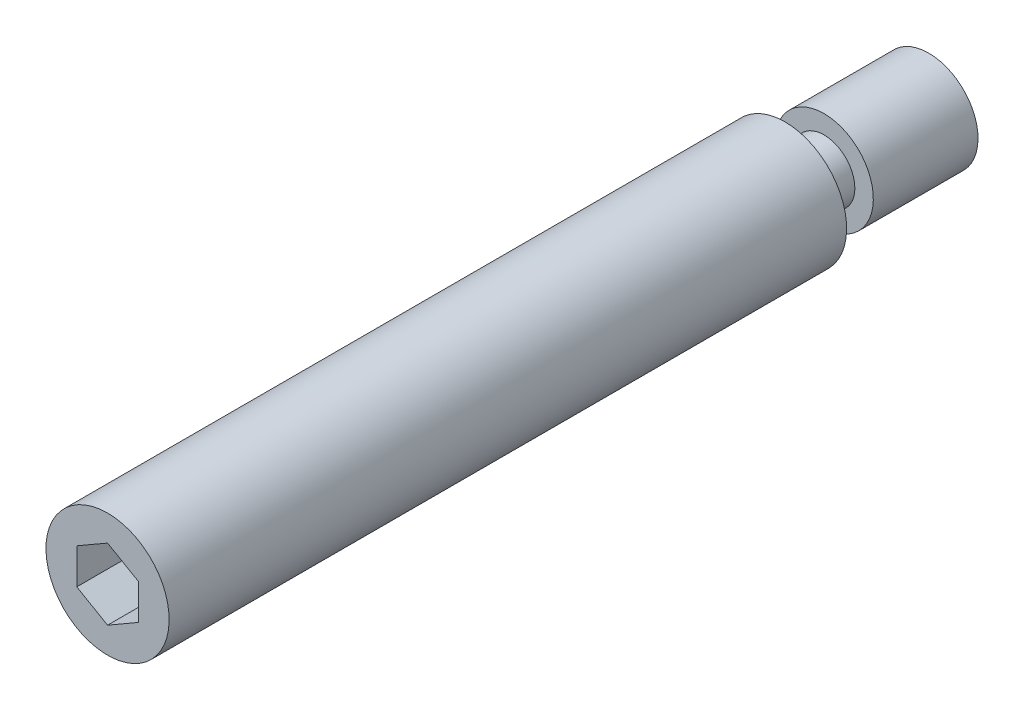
ISO-10303-21;
HEADER;
FILE_DESCRIPTION(('STEP AP214'),'2;1');
FILE_NAME('part.step','',(''),(''),'','','');
FILE_SCHEMA(('AUTOMOTIVE_DESIGN { 1 0 10303 214 1 1 1 1 }'));
ENDSEC;
DATA;
#1=APPLICATION_CONTEXT('core data for automotive mechanical design processes');
#2=APPLICATION_PROTOCOL_DEFINITION('international standard','automotive_design',2000,#1);
#3=PRODUCT_CONTEXT('',#1,'mechanical');
#4=PRODUCT('Part','Part','',(#3));
#5=PRODUCT_RELATED_PRODUCT_CATEGORY('part','',(#4));
#6=PRODUCT_DEFINITION_FORMATION('','',#4);
#7=PRODUCT_DEFINITION_CONTEXT('part definition',#1,'design');
#8=PRODUCT_DEFINITION('design','',#6,#7);
#9=PRODUCT_DEFINITION_SHAPE('','',#8);
#10=(LENGTH_UNIT() NAMED_UNIT(*) SI_UNIT(.MILLI.,.METRE.));
#11=(NAMED_UNIT(*) PLANE_ANGLE_UNIT() SI_UNIT($,.RADIAN.));
#12=(NAMED_UNIT(*) SI_UNIT($,.STERADIAN.) SOLID_ANGLE_UNIT());
#13=UNCERTAINTY_MEASURE_WITH_UNIT(LENGTH_MEASURE(1.E-05),#10,'distance_accuracy_value','');
#14=(GEOMETRIC_REPRESENTATION_CONTEXT(3) GLOBAL_UNCERTAINTY_ASSIGNED_CONTEXT((#13)) GLOBAL_UNIT_ASSIGNED_CONTEXT((#10,
#11,#12)) REPRESENTATION_CONTEXT('',''));
#15=CARTESIAN_POINT('',(0.,0.,0.));
#16=DIRECTION('',(0.,0.,1.));
#17=DIRECTION('',(1.,0.,0.));
#18=AXIS2_PLACEMENT_3D('',#15,#16,#17);
#19=CARTESIAN_POINT('',(0.,-3.,7.));
#20=DIRECTION('',(0.,0.,-1.));
#21=DIRECTION('',(0.,-1.,0.));
#22=AXIS2_PLACEMENT_3D('',#19,#20,#21);
#23=PLANE('',#22);
#24=CARTESIAN_POINT('',(0.,0.,7.));
#25=DIRECTION('',(0.,0.,1.));
#26=DIRECTION('',(0.,1.,0.));
#27=AXIS2_PLACEMENT_3D('',#24,#25,#26);
#28=CIRCLE('',#27,1.5);
#29=CARTESIAN_POINT('',(0.,1.5,7.));
#30=VERTEX_POINT('',#29);
#31=EDGE_CURVE('E115',#30,#30,#28,.T.);
#32=ORIENTED_EDGE('',*,*,#31,.T.);
#33=EDGE_LOOP('',(#32));
#34=FACE_BOUND('',#33,.T.);
#35=CARTESIAN_POINT('',(0.,0.,7.));
#36=DIRECTION('',(0.,0.,1.));
#37=DIRECTION('',(0.,1.,0.));
#38=AXIS2_PLACEMENT_3D('',#35,#36,#37);
#39=CIRCLE('',#38,3.);
#40=CARTESIAN_POINT('',(0.,3.,7.));
#41=VERTEX_POINT('',#40);
#42=EDGE_CURVE('E9',#41,#41,#39,.T.);
#43=ORIENTED_EDGE('',*,*,#42,.F.);
#44=EDGE_LOOP('',(#43));
#45=FACE_BOUND('',#44,.T.);
#46=ADVANCED_FACE('F14',(#34,#45),#23,.T.);
#47=CARTESIAN_POINT('',(0.,0.,20.));
#48=DIRECTION('',(0.,0.,1.));
#49=DIRECTION('',(0.,1.,0.));
#50=AXIS2_PLACEMENT_3D('',#47,#48,#49);
#51=CYLINDRICAL_SURFACE('',#50,3.);
#52=CARTESIAN_POINT('',(0.,0.,40.));
#53=DIRECTION('',(0.,0.,1.));
#54=DIRECTION('',(0.,1.,0.));
#55=AXIS2_PLACEMENT_3D('',#52,#53,#54);
#56=CIRCLE('',#55,3.);
#57=CARTESIAN_POINT('',(0.,3.,40.));
#58=VERTEX_POINT('',#57);
#59=EDGE_CURVE('E21',#58,#58,#56,.T.);
#60=ORIENTED_EDGE('',*,*,#59,.F.);
#61=EDGE_LOOP('',(#60));
#62=FACE_BOUND('',#61,.T.);
#63=ORIENTED_EDGE('',*,*,#42,.T.);
#64=EDGE_LOOP('',(#63));
#65=FACE_BOUND('',#64,.T.);
#66=ADVANCED_FACE('F136',(#62,#65),#51,.T.);
#67=CARTESIAN_POINT('',(0.,-3.,40.));
#68=DIRECTION('',(0.,0.,-1.));
#69=DIRECTION('',(0.,-1.,0.));
#70=AXIS2_PLACEMENT_3D('',#67,#68,#69);
#71=PLANE('',#70);
#72=DIRECTION('',(-0.866025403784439,-0.5,0.));
#73=VECTOR('',#72,1.);
#74=CARTESIAN_POINT('',(0.,1.73205080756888,40.));
#75=LINE('',#74,#73);
#76=CARTESIAN_POINT('',(0.,1.73205080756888,40.));
#77=VERTEX_POINT('',#76);
#78=CARTESIAN_POINT('',(-1.5,0.866025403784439,40.));
#79=VERTEX_POINT('',#78);
#80=EDGE_CURVE('E102',#77,#79,#75,.T.);
#81=ORIENTED_EDGE('',*,*,#80,.F.);
#82=DIRECTION('',(-0.866025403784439,0.5,0.));
#83=VECTOR('',#82,1.);
#84=CARTESIAN_POINT('',(1.5,0.86602540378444,40.));
#85=LINE('',#84,#83);
#86=CARTESIAN_POINT('',(1.5,0.86602540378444,40.));
#87=VERTEX_POINT('',#86);
#88=EDGE_CURVE('E28',#87,#77,#85,.T.);
#89=ORIENTED_EDGE('',*,*,#88,.F.);
#90=DIRECTION('',(0.,1.,0.));
#91=VECTOR('',#90,1.);
#92=CARTESIAN_POINT('',(1.5,-0.866025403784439,40.));
#93=LINE('',#92,#91);
#94=CARTESIAN_POINT('',(1.5,-0.866025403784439,40.));
#95=VERTEX_POINT('',#94);
#96=EDGE_CURVE('E111',#95,#87,#93,.T.);
#97=ORIENTED_EDGE('',*,*,#96,.F.);
#98=DIRECTION('',(0.866025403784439,0.5,0.));
#99=VECTOR('',#98,1.);
#100=CARTESIAN_POINT('',(0.,-1.73205080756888,40.));
#101=LINE('',#100,#99);
#102=CARTESIAN_POINT('',(0.,-1.73205080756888,40.));
#103=VERTEX_POINT('',#102);
#104=EDGE_CURVE('E109',#103,#95,#101,.T.);
#105=ORIENTED_EDGE('',*,*,#104,.F.);
#106=DIRECTION('',(0.866025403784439,-0.5,0.));
#107=VECTOR('',#106,1.);
#108=CARTESIAN_POINT('',(-1.5,-0.866025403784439,40.));
#109=LINE('',#108,#107);
#110=CARTESIAN_POINT('',(-1.5,-0.866025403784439,40.));
#111=VERTEX_POINT('',#110);
#112=EDGE_CURVE('E76',#111,#103,#109,.T.);
#113=ORIENTED_EDGE('',*,*,#112,.F.);
#114=DIRECTION('',(0.,-1.,0.));
#115=VECTOR('',#114,1.);
#116=CARTESIAN_POINT('',(-1.5,0.866025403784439,40.));
#117=LINE('',#116,#115);
#118=EDGE_CURVE('E105',#79,#111,#117,.T.);
#119=ORIENTED_EDGE('',*,*,#118,.F.);
#120=EDGE_LOOP('',(#81,#89,#97,#105,#113,#119));
#121=FACE_BOUND('',#120,.T.);
#122=ORIENTED_EDGE('',*,*,#59,.T.);
#123=EDGE_LOOP('',(#122));
#124=FACE_BOUND('',#123,.T.);
#125=ADVANCED_FACE('F134',(#121,#124),#71,.F.);
#126=CARTESIAN_POINT('',(0.,-2.4,0.));
#127=DIRECTION('',(0.,0.,-1.));
#128=DIRECTION('',(0.,-1.,0.));
#129=AXIS2_PLACEMENT_3D('',#126,#127,#128);
#130=PLANE('',#129);
#131=CARTESIAN_POINT('',(0.,0.,0.));
#132=DIRECTION('',(0.,0.,1.));
#133=DIRECTION('',(0.,1.,0.));
#134=AXIS2_PLACEMENT_3D('',#131,#132,#133);
#135=CIRCLE('',#134,2.4);
#136=CARTESIAN_POINT('',(0.,2.4,0.));
#137=VERTEX_POINT('',#136);
#138=EDGE_CURVE('E129',#137,#137,#135,.T.);
#139=ORIENTED_EDGE('',*,*,#138,.F.);
#140=EDGE_LOOP('',(#139));
#141=FACE_BOUND('',#140,.T.);
#142=ADVANCED_FACE('F167',(#141),#130,.T.);
#143=CARTESIAN_POINT('',(0.,0.,20.));
#144=DIRECTION('',(0.,0.,1.));
#145=DIRECTION('',(0.,1.,0.));
#146=AXIS2_PLACEMENT_3D('',#143,#144,#145);
#147=CYLINDRICAL_SURFACE('',#146,2.4);
#148=ORIENTED_EDGE('',*,*,#138,.T.);
#149=EDGE_LOOP('',(#148));
#150=FACE_BOUND('',#149,.T.);
#151=CARTESIAN_POINT('',(0.,0.,5.1));
#152=DIRECTION('',(0.,0.,1.));
#153=DIRECTION('',(0.,1.,0.));
#154=AXIS2_PLACEMENT_3D('',#151,#152,#153);
#155=CIRCLE('',#154,2.4);
#156=CARTESIAN_POINT('',(0.,2.4,5.1));
#157=VERTEX_POINT('',#156);
#158=EDGE_CURVE('E126',#157,#157,#155,.T.);
#159=ORIENTED_EDGE('',*,*,#158,.F.);
#160=EDGE_LOOP('',(#159));
#161=FACE_BOUND('',#160,.T.);
#162=ADVANCED_FACE('F160',(#150,#161),#147,.T.);
#163=CARTESIAN_POINT('',(0.,-1.5,5.1));
#164=DIRECTION('',(0.,0.,1.));
#165=DIRECTION('',(0.,1.,0.));
#166=AXIS2_PLACEMENT_3D('',#163,#164,#165);
#167=PLANE('',#166);
#168=ORIENTED_EDGE('',*,*,#158,.T.);
#169=EDGE_LOOP('',(#168));
#170=FACE_BOUND('',#169,.T.);
#171=CARTESIAN_POINT('',(0.,0.,5.1));
#172=DIRECTION('',(0.,0.,1.));
#173=DIRECTION('',(0.,1.,0.));
#174=AXIS2_PLACEMENT_3D('',#171,#172,#173);
#175=CIRCLE('',#174,1.5);
#176=CARTESIAN_POINT('',(0.,1.5,5.1));
#177=VERTEX_POINT('',#176);
#178=EDGE_CURVE('E123',#177,#177,#175,.T.);
#179=ORIENTED_EDGE('',*,*,#178,.F.);
#180=EDGE_LOOP('',(#179));
#181=FACE_BOUND('',#180,.T.);
#182=ADVANCED_FACE('F151',(#170,#181),#167,.T.);
#183=CARTESIAN_POINT('',(0.,0.,20.));
#184=DIRECTION('',(0.,0.,1.));
#185=DIRECTION('',(0.,1.,0.));
#186=AXIS2_PLACEMENT_3D('',#183,#184,#185);
#187=CYLINDRICAL_SURFACE('',#186,1.5);
#188=ORIENTED_EDGE('',*,*,#178,.T.);
#189=EDGE_LOOP('',(#188));
#190=FACE_BOUND('',#189,.T.);
#191=ORIENTED_EDGE('',*,*,#31,.F.);
#192=EDGE_LOOP('',(#191));
#193=FACE_BOUND('',#192,.T.);
#194=ADVANCED_FACE('F148',(#190,#193),#187,.T.);
#195=CARTESIAN_POINT('',(1.5,0.86602540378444,36.));
#196=DIRECTION('',(0.5,0.866025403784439,0.));
#197=DIRECTION('',(-0.866025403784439,0.5,0.));
#198=AXIS2_PLACEMENT_3D('',#195,#196,#197);
#199=PLANE('',#198);
#200=ORIENTED_EDGE('',*,*,#88,.T.);
#201=DIRECTION('',(0.,0.,1.));
#202=VECTOR('',#201,1.);
#203=CARTESIAN_POINT('',(0.,1.73205080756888,36.));
#204=LINE('',#203,#202);
#205=CARTESIAN_POINT('',(0.,1.73205080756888,36.));
#206=VERTEX_POINT('',#205);
#207=EDGE_CURVE('E58',#206,#77,#204,.T.);
#208=ORIENTED_EDGE('',*,*,#207,.F.);
#209=DIRECTION('',(-0.866025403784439,0.5,0.));
#210=VECTOR('',#209,1.);
#211=CARTESIAN_POINT('',(1.5,0.86602540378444,36.));
#212=LINE('',#211,#210);
#213=CARTESIAN_POINT('',(1.5,0.86602540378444,36.));
#214=VERTEX_POINT('',#213);
#215=EDGE_CURVE('E113',#214,#206,#212,.T.);
#216=ORIENTED_EDGE('',*,*,#215,.F.);
#217=DIRECTION('',(0.,0.,1.));
#218=VECTOR('',#217,1.);
#219=CARTESIAN_POINT('',(1.5,0.86602540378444,36.));
#220=LINE('',#219,#218);
#221=EDGE_CURVE('E36',#214,#87,#220,.T.);
#222=ORIENTED_EDGE('',*,*,#221,.T.);
#223=EDGE_LOOP('',(#200,#208,#216,#222));
#224=FACE_BOUND('',#223,.T.);
#225=ADVANCED_FACE('F150',(#224),#199,.F.);
#226=CARTESIAN_POINT('',(1.5,-0.866025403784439,36.));
#227=DIRECTION('',(1.,0.,0.));
#228=DIRECTION('',(0.,1.,0.));
#229=AXIS2_PLACEMENT_3D('',#226,#227,#228);
#230=PLANE('',#229);
#231=ORIENTED_EDGE('',*,*,#96,.T.);
#232=ORIENTED_EDGE('',*,*,#221,.F.);
#233=DIRECTION('',(0.,1.,0.));
#234=VECTOR('',#233,1.);
#235=CARTESIAN_POINT('',(1.5,-0.866025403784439,36.));
#236=LINE('',#235,#234);
#237=CARTESIAN_POINT('',(1.5,-0.866025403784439,36.));
#238=VERTEX_POINT('',#237);
#239=EDGE_CURVE('E88',#238,#214,#236,.T.);
#240=ORIENTED_EDGE('',*,*,#239,.F.);
#241=DIRECTION('',(0.,0.,1.));
#242=VECTOR('',#241,1.);
#243=CARTESIAN_POINT('',(1.5,-0.866025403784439,36.));
#244=LINE('',#243,#242);
#245=EDGE_CURVE('E80',#238,#95,#244,.T.);
#246=ORIENTED_EDGE('',*,*,#245,.T.);
#247=EDGE_LOOP('',(#231,#232,#240,#246));
#248=FACE_BOUND('',#247,.T.);
#249=ADVANCED_FACE('F158',(#248),#230,.F.);
#250=CARTESIAN_POINT('',(0.,-1.73205080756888,36.));
#251=DIRECTION('',(0.5,-0.866025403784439,0.));
#252=DIRECTION('',(0.866025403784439,0.5,0.));
#253=AXIS2_PLACEMENT_3D('',#250,#251,#252);
#254=PLANE('',#253);
#255=ORIENTED_EDGE('',*,*,#104,.T.);
#256=ORIENTED_EDGE('',*,*,#245,.F.);
#257=DIRECTION('',(0.866025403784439,0.5,0.));
#258=VECTOR('',#257,1.);
#259=CARTESIAN_POINT('',(0.,-1.73205080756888,36.));
#260=LINE('',#259,#258);
#261=CARTESIAN_POINT('',(0.,-1.73205080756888,36.));
#262=VERTEX_POINT('',#261);
#263=EDGE_CURVE('E84',#262,#238,#260,.T.);
#264=ORIENTED_EDGE('',*,*,#263,.F.);
#265=DIRECTION('',(0.,0.,1.));
#266=VECTOR('',#265,1.);
#267=CARTESIAN_POINT('',(0.,-1.73205080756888,36.));
#268=LINE('',#267,#266);
#269=EDGE_CURVE('E69',#262,#103,#268,.T.);
#270=ORIENTED_EDGE('',*,*,#269,.T.);
#271=EDGE_LOOP('',(#255,#256,#264,#270));
#272=FACE_BOUND('',#271,.T.);
#273=ADVANCED_FACE('F85',(#272),#254,.F.);
#274=CARTESIAN_POINT('',(-1.5,-0.866025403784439,36.));
#275=DIRECTION('',(-0.5,-0.866025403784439,0.));
#276=DIRECTION('',(0.866025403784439,-0.5,0.));
#277=AXIS2_PLACEMENT_3D('',#274,#275,#276);
#278=PLANE('',#277);
#279=ORIENTED_EDGE('',*,*,#112,.T.);
#280=ORIENTED_EDGE('',*,*,#269,.F.);
#281=DIRECTION('',(0.866025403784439,-0.5,0.));
#282=VECTOR('',#281,1.);
#283=CARTESIAN_POINT('',(-1.5,-0.866025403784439,36.));
#284=LINE('',#283,#282);
#285=CARTESIAN_POINT('',(-1.5,-0.866025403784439,36.));
#286=VERTEX_POINT('',#285);
#287=EDGE_CURVE('E73',#286,#262,#284,.T.);
#288=ORIENTED_EDGE('',*,*,#287,.F.);
#289=DIRECTION('',(0.,0.,1.));
#290=VECTOR('',#289,1.);
#291=CARTESIAN_POINT('',(-1.5,-0.866025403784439,36.));
#292=LINE('',#291,#290);
#293=EDGE_CURVE('E81',#286,#111,#292,.T.);
#294=ORIENTED_EDGE('',*,*,#293,.T.);
#295=EDGE_LOOP('',(#279,#280,#288,#294));
#296=FACE_BOUND('',#295,.T.);
#297=ADVANCED_FACE('F71',(#296),#278,.F.);
#298=CARTESIAN_POINT('',(-1.5,0.866025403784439,36.));
#299=DIRECTION('',(-1.,0.,0.));
#300=DIRECTION('',(0.,-1.,0.));
#301=AXIS2_PLACEMENT_3D('',#298,#299,#300);
#302=PLANE('',#301);
#303=ORIENTED_EDGE('',*,*,#118,.T.);
#304=ORIENTED_EDGE('',*,*,#293,.F.);
#305=DIRECTION('',(0.,-1.,0.));
#306=VECTOR('',#305,1.);
#307=CARTESIAN_POINT('',(-1.5,0.866025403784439,36.));
#308=LINE('',#307,#306);
#309=CARTESIAN_POINT('',(-1.5,0.866025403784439,36.));
#310=VERTEX_POINT('',#309);
#311=EDGE_CURVE('E94',#310,#286,#308,.T.);
#312=ORIENTED_EDGE('',*,*,#311,.F.);
#313=DIRECTION('',(0.,0.,1.));
#314=VECTOR('',#313,1.);
#315=CARTESIAN_POINT('',(-1.5,0.866025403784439,36.));
#316=LINE('',#315,#314);
#317=EDGE_CURVE('E118',#310,#79,#316,.T.);
#318=ORIENTED_EDGE('',*,*,#317,.T.);
#319=EDGE_LOOP('',(#303,#304,#312,#318));
#320=FACE_BOUND('',#319,.T.);
#321=ADVANCED_FACE('F192',(#320),#302,.F.);
#322=CARTESIAN_POINT('',(0.,1.73205080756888,36.));
#323=DIRECTION('',(-0.5,0.866025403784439,0.));
#324=DIRECTION('',(-0.866025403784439,-0.5,0.));
#325=AXIS2_PLACEMENT_3D('',#322,#323,#324);
#326=PLANE('',#325);
#327=ORIENTED_EDGE('',*,*,#80,.T.);
#328=ORIENTED_EDGE('',*,*,#317,.F.);
#329=DIRECTION('',(-0.866025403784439,-0.5,0.));
#330=VECTOR('',#329,1.);
#331=CARTESIAN_POINT('',(0.,1.73205080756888,36.));
#332=LINE('',#331,#330);
#333=EDGE_CURVE('E96',#206,#310,#332,.T.);
#334=ORIENTED_EDGE('',*,*,#333,.F.);
#335=ORIENTED_EDGE('',*,*,#207,.T.);
#336=EDGE_LOOP('',(#327,#328,#334,#335));
#337=FACE_BOUND('',#336,.T.);
#338=ADVANCED_FACE('F180',(#337),#326,.F.);
#339=CARTESIAN_POINT('',(0.,1.73205080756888,36.));
#340=DIRECTION('',(0.,0.,1.));
#341=DIRECTION('',(1.,0.,0.));
#342=AXIS2_PLACEMENT_3D('',#339,#340,#341);
#343=PLANE('',#342);
#344=ORIENTED_EDGE('',*,*,#215,.T.);
#345=ORIENTED_EDGE('',*,*,#333,.T.);
#346=ORIENTED_EDGE('',*,*,#311,.T.);
#347=ORIENTED_EDGE('',*,*,#287,.T.);
#348=ORIENTED_EDGE('',*,*,#263,.T.);
#349=ORIENTED_EDGE('',*,*,#239,.T.);
#350=EDGE_LOOP('',(#344,#345,#346,#347,#348,#349));
#351=FACE_BOUND('',#350,.T.);
#352=ADVANCED_FACE('F91',(#351),#343,.T.);
#353=CLOSED_SHELL('',(#46,#66,#125,#142,#162,#182,#194,#225,#249,#273,#297,#321,#338,#352));
#354=MANIFOLD_SOLID_BREP('B1',#353);
#355=ADVANCED_BREP_SHAPE_REPRESENTATION('',(#18,#354),#14);
#356=SHAPE_DEFINITION_REPRESENTATION(#9,#355);
ENDSEC;
END-ISO-10303-21;
